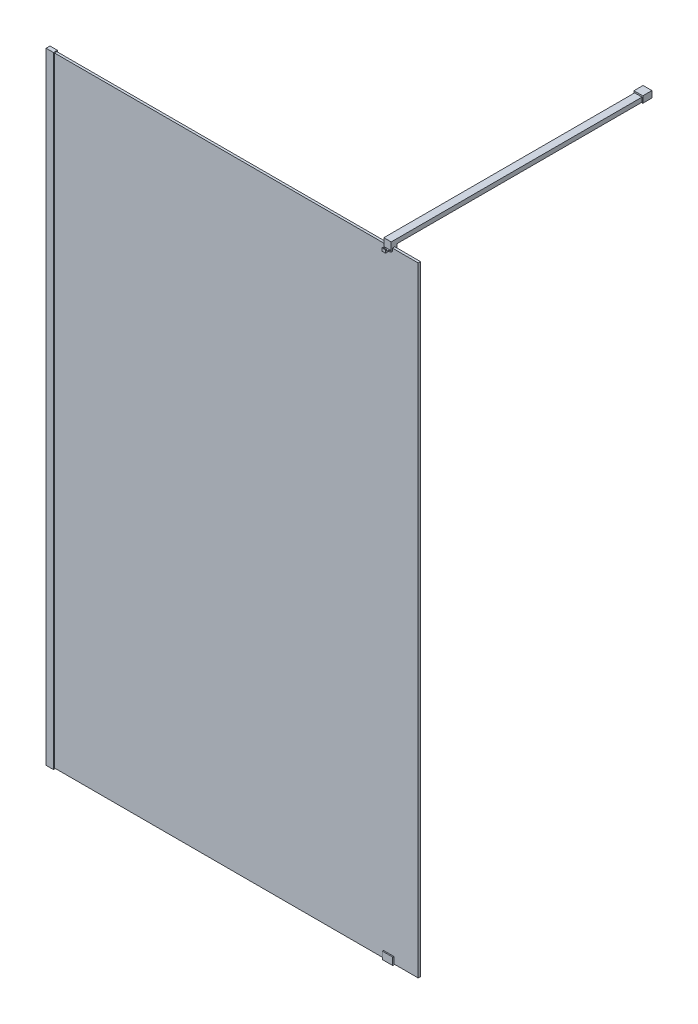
ISO-10303-21;
HEADER;
FILE_DESCRIPTION(('STEP AP214'),'2;1');
FILE_NAME('part.step','',(''),(''),'','','');
FILE_SCHEMA(('AUTOMOTIVE_DESIGN { 1 0 10303 214 1 1 1 1 }'));
ENDSEC;
DATA;
#1=APPLICATION_CONTEXT('core data for automotive mechanical design processes');
#2=APPLICATION_PROTOCOL_DEFINITION('international standard','automotive_design',2000,#1);
#3=PRODUCT_CONTEXT('',#1,'mechanical');
#4=PRODUCT('Part','Part','',(#3));
#5=PRODUCT_RELATED_PRODUCT_CATEGORY('part','',(#4));
#6=PRODUCT_DEFINITION_FORMATION('','',#4);
#7=PRODUCT_DEFINITION_CONTEXT('part definition',#1,'design');
#8=PRODUCT_DEFINITION('design','',#6,#7);
#9=PRODUCT_DEFINITION_SHAPE('','',#8);
#10=(LENGTH_UNIT() NAMED_UNIT(*) SI_UNIT(.MILLI.,.METRE.));
#11=(NAMED_UNIT(*) PLANE_ANGLE_UNIT() SI_UNIT($,.RADIAN.));
#12=(NAMED_UNIT(*) SI_UNIT($,.STERADIAN.) SOLID_ANGLE_UNIT());
#13=UNCERTAINTY_MEASURE_WITH_UNIT(LENGTH_MEASURE(1.E-05),#10,'distance_accuracy_value','');
#14=(GEOMETRIC_REPRESENTATION_CONTEXT(3) GLOBAL_UNCERTAINTY_ASSIGNED_CONTEXT((#13)) GLOBAL_UNIT_ASSIGNED_CONTEXT((#10,
#11,#12)) REPRESENTATION_CONTEXT('',''));
#15=CARTESIAN_POINT('',(0.,0.,0.));
#16=DIRECTION('',(0.,0.,1.));
#17=DIRECTION('',(1.,0.,0.));
#18=AXIS2_PLACEMENT_3D('',#15,#16,#17);
#19=CARTESIAN_POINT('',(1170.95,2090.,-19.4000000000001));
#20=DIRECTION('',(-1.,0.,0.));
#21=DIRECTION('',(0.,0.,1.));
#22=AXIS2_PLACEMENT_3D('',#19,#20,#21);
#23=PLANE('',#22);
#24=DIRECTION('',(0.,-1.,0.));
#25=VECTOR('',#24,1.);
#26=CARTESIAN_POINT('',(1170.95,2090.,-850.03));
#27=LINE('',#26,#25);
#28=CARTESIAN_POINT('',(1170.95,2120.,-850.03));
#29=VERTEX_POINT('',#28);
#30=CARTESIAN_POINT('',(1170.95,2105.,-850.03));
#31=VERTEX_POINT('',#30);
#32=EDGE_CURVE('E61',#29,#31,#27,.T.);
#33=ORIENTED_EDGE('',*,*,#32,.F.);
#34=DIRECTION('',(0.,0.,1.));
#35=VECTOR('',#34,1.);
#36=CARTESIAN_POINT('',(1170.95,2120.,0.599999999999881));
#37=LINE('',#36,#35);
#38=CARTESIAN_POINT('',(1170.95,2120.,0.599999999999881));
#39=VERTEX_POINT('',#38);
#40=EDGE_CURVE('E386',#29,#39,#37,.T.);
#41=ORIENTED_EDGE('',*,*,#40,.T.);
#42=DIRECTION('',(0.,-1.,0.));
#43=VECTOR('',#42,1.);
#44=CARTESIAN_POINT('',(1170.95,2094.,0.599999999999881));
#45=LINE('',#44,#43);
#46=CARTESIAN_POINT('',(1170.95,2094.,0.599999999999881));
#47=VERTEX_POINT('',#46);
#48=EDGE_CURVE('E388',#39,#47,#45,.T.);
#49=ORIENTED_EDGE('',*,*,#48,.T.);
#50=DIRECTION('',(0.,1.,0.));
#51=VECTOR('',#50,1.);
#52=CARTESIAN_POINT('',(1170.95,2090.,0.599999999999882));
#53=LINE('',#52,#51);
#54=CARTESIAN_POINT('',(1170.95,2090.,0.599999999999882));
#55=VERTEX_POINT('',#54);
#56=EDGE_CURVE('E332',#55,#47,#53,.T.);
#57=ORIENTED_EDGE('',*,*,#56,.F.);
#58=DIRECTION('',(0.,0.,-1.));
#59=VECTOR('',#58,1.);
#60=CARTESIAN_POINT('',(1170.95,2090.,-3.40000000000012));
#61=LINE('',#60,#59);
#62=CARTESIAN_POINT('',(1170.95,2090.,-3.40000000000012));
#63=VERTEX_POINT('',#62);
#64=EDGE_CURVE('E362',#55,#63,#61,.T.);
#65=ORIENTED_EDGE('',*,*,#64,.T.);
#66=DIRECTION('',(0.,1.,-1.30407837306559E-13));
#67=VECTOR('',#66,1.);
#68=CARTESIAN_POINT('',(1170.95,2100.,-3.40000000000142));
#69=LINE('',#68,#67);
#70=CARTESIAN_POINT('',(1170.95,2100.,-3.40000000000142));
#71=VERTEX_POINT('',#70);
#72=EDGE_CURVE('E392',#63,#71,#69,.T.);
#73=ORIENTED_EDGE('',*,*,#72,.T.);
#74=DIRECTION('',(0.,0.,-1.));
#75=VECTOR('',#74,1.);
#76=CARTESIAN_POINT('',(1170.95,2100.,-11.4000000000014));
#77=LINE('',#76,#75);
#78=CARTESIAN_POINT('',(1170.95,2100.,-11.4000000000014));
#79=VERTEX_POINT('',#78);
#80=EDGE_CURVE('E394',#71,#79,#77,.T.);
#81=ORIENTED_EDGE('',*,*,#80,.T.);
#82=DIRECTION('',(0.,-1.,1.30451205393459E-13));
#83=VECTOR('',#82,1.);
#84=CARTESIAN_POINT('',(1170.95,2090.,-11.4000000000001));
#85=LINE('',#84,#83);
#86=CARTESIAN_POINT('',(1170.95,2090.,-11.4000000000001));
#87=VERTEX_POINT('',#86);
#88=EDGE_CURVE('E395',#79,#87,#85,.T.);
#89=ORIENTED_EDGE('',*,*,#88,.T.);
#90=DIRECTION('',(0.,0.,-1.));
#91=VECTOR('',#90,1.);
#92=CARTESIAN_POINT('',(1170.95,2090.,-19.4000000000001));
#93=LINE('',#92,#91);
#94=CARTESIAN_POINT('',(1170.95,2090.,-19.4000000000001));
#95=VERTEX_POINT('',#94);
#96=EDGE_CURVE('E283',#87,#95,#93,.T.);
#97=ORIENTED_EDGE('',*,*,#96,.T.);
#98=DIRECTION('',(0.,1.,0.));
#99=VECTOR('',#98,1.);
#100=CARTESIAN_POINT('',(1170.95,2120.,-19.4000000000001));
#101=LINE('',#100,#99);
#102=CARTESIAN_POINT('',(1170.95,2105.,-19.4000000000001));
#103=VERTEX_POINT('',#102);
#104=EDGE_CURVE('E249',#95,#103,#101,.T.);
#105=ORIENTED_EDGE('',*,*,#104,.T.);
#106=DIRECTION('',(0.,0.,-1.));
#107=VECTOR('',#106,1.);
#108=CARTESIAN_POINT('',(1170.95,2105.,-881.03));
#109=LINE('',#108,#107);
#110=EDGE_CURVE('E248',#103,#31,#109,.T.);
#111=ORIENTED_EDGE('',*,*,#110,.T.);
#112=EDGE_LOOP('',(#33,#41,#49,#57,#65,#73,#81,#89,#97,#105,#111));
#113=FACE_BOUND('',#112,.T.);
#114=ADVANCED_FACE('F46',(#113),#23,.F.);
#115=CARTESIAN_POINT('',(1145.95,2090.,-19.4000000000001));
#116=DIRECTION('',(-1.,0.,0.));
#117=DIRECTION('',(0.,0.,1.));
#118=AXIS2_PLACEMENT_3D('',#115,#116,#117);
#119=PLANE('',#118);
#120=DIRECTION('',(0.,0.,1.));
#121=VECTOR('',#120,1.);
#122=CARTESIAN_POINT('',(1145.95,2120.,0.599999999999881));
#123=LINE('',#122,#121);
#124=CARTESIAN_POINT('',(1145.95,2120.,-850.03));
#125=VERTEX_POINT('',#124);
#126=CARTESIAN_POINT('',(1145.95,2120.,0.599999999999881));
#127=VERTEX_POINT('',#126);
#128=EDGE_CURVE('E272',#125,#127,#123,.T.);
#129=ORIENTED_EDGE('',*,*,#128,.F.);
#130=DIRECTION('',(0.,-1.,0.));
#131=VECTOR('',#130,1.);
#132=CARTESIAN_POINT('',(1145.95,2090.,-850.03));
#133=LINE('',#132,#131);
#134=CARTESIAN_POINT('',(1145.95,2105.,-850.03));
#135=VERTEX_POINT('',#134);
#136=EDGE_CURVE('E230',#125,#135,#133,.T.);
#137=ORIENTED_EDGE('',*,*,#136,.T.);
#138=DIRECTION('',(0.,0.,1.));
#139=VECTOR('',#138,1.);
#140=CARTESIAN_POINT('',(1145.95,2105.,-881.03));
#141=LINE('',#140,#139);
#142=CARTESIAN_POINT('',(1145.95,2105.,-19.4000000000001));
#143=VERTEX_POINT('',#142);
#144=EDGE_CURVE('E238',#135,#143,#141,.T.);
#145=ORIENTED_EDGE('',*,*,#144,.T.);
#146=DIRECTION('',(0.,1.,0.));
#147=VECTOR('',#146,1.);
#148=CARTESIAN_POINT('',(1145.95,2120.,-19.4000000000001));
#149=LINE('',#148,#147);
#150=CARTESIAN_POINT('',(1145.95,2090.,-19.4000000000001));
#151=VERTEX_POINT('',#150);
#152=EDGE_CURVE('E262',#151,#143,#149,.T.);
#153=ORIENTED_EDGE('',*,*,#152,.F.);
#154=DIRECTION('',(0.,0.,-1.));
#155=VECTOR('',#154,1.);
#156=CARTESIAN_POINT('',(1145.95,2090.,-19.4000000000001));
#157=LINE('',#156,#155);
#158=CARTESIAN_POINT('',(1145.95,2090.,-11.4000000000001));
#159=VERTEX_POINT('',#158);
#160=EDGE_CURVE('E296',#159,#151,#157,.T.);
#161=ORIENTED_EDGE('',*,*,#160,.F.);
#162=DIRECTION('',(0.,-1.,1.30451205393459E-13));
#163=VECTOR('',#162,1.);
#164=CARTESIAN_POINT('',(1145.95,2090.,-11.4000000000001));
#165=LINE('',#164,#163);
#166=CARTESIAN_POINT('',(1145.95,2100.,-11.4000000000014));
#167=VERTEX_POINT('',#166);
#168=EDGE_CURVE('E294',#167,#159,#165,.T.);
#169=ORIENTED_EDGE('',*,*,#168,.F.);
#170=DIRECTION('',(0.,0.,-1.));
#171=VECTOR('',#170,1.);
#172=CARTESIAN_POINT('',(1145.95,2100.,-11.4000000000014));
#173=LINE('',#172,#171);
#174=CARTESIAN_POINT('',(1145.95,2100.,-3.40000000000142));
#175=VERTEX_POINT('',#174);
#176=EDGE_CURVE('E292',#175,#167,#173,.T.);
#177=ORIENTED_EDGE('',*,*,#176,.F.);
#178=DIRECTION('',(0.,1.,-1.30407837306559E-13));
#179=VECTOR('',#178,1.);
#180=CARTESIAN_POINT('',(1145.95,2100.,-3.40000000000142));
#181=LINE('',#180,#179);
#182=CARTESIAN_POINT('',(1145.95,2090.,-3.40000000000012));
#183=VERTEX_POINT('',#182);
#184=EDGE_CURVE('E290',#183,#175,#181,.T.);
#185=ORIENTED_EDGE('',*,*,#184,.F.);
#186=DIRECTION('',(0.,0.,-1.));
#187=VECTOR('',#186,1.);
#188=CARTESIAN_POINT('',(1145.95,2090.,-3.40000000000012));
#189=LINE('',#188,#187);
#190=CARTESIAN_POINT('',(1145.95,2090.,0.599999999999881));
#191=VERTEX_POINT('',#190);
#192=EDGE_CURVE('E288',#191,#183,#189,.T.);
#193=ORIENTED_EDGE('',*,*,#192,.F.);
#194=DIRECTION('',(0.,1.,0.));
#195=VECTOR('',#194,1.);
#196=CARTESIAN_POINT('',(1145.95,2090.,0.599999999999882));
#197=LINE('',#196,#195);
#198=CARTESIAN_POINT('',(1145.95,2094.,0.599999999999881));
#199=VERTEX_POINT('',#198);
#200=EDGE_CURVE('E329',#191,#199,#197,.T.);
#201=ORIENTED_EDGE('',*,*,#200,.T.);
#202=DIRECTION('',(0.,-1.,0.));
#203=VECTOR('',#202,1.);
#204=CARTESIAN_POINT('',(1145.95,2094.,0.599999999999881));
#205=LINE('',#204,#203);
#206=EDGE_CURVE('E274',#127,#199,#205,.T.);
#207=ORIENTED_EDGE('',*,*,#206,.F.);
#208=EDGE_LOOP('',(#129,#137,#145,#153,#161,#169,#177,#185,#193,#201,#207));
#209=FACE_BOUND('',#208,.T.);
#210=ADVANCED_FACE('F259',(#209),#119,.T.);
#211=CARTESIAN_POINT('',(1170.95,2120.,0.599999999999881));
#212=DIRECTION('',(0.,-1.,0.));
#213=DIRECTION('',(0.,0.,-1.));
#214=AXIS2_PLACEMENT_3D('',#211,#212,#213);
#215=PLANE('',#214);
#216=DIRECTION('',(1.,0.,0.));
#217=VECTOR('',#216,1.);
#218=CARTESIAN_POINT('',(1170.95,2120.,-850.03));
#219=LINE('',#218,#217);
#220=EDGE_CURVE('E68',#125,#29,#219,.T.);
#221=ORIENTED_EDGE('',*,*,#220,.F.);
#222=ORIENTED_EDGE('',*,*,#128,.T.);
#223=DIRECTION('',(-1.,0.,0.));
#224=VECTOR('',#223,1.);
#225=CARTESIAN_POINT('',(1170.95,2120.,0.599999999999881));
#226=LINE('',#225,#224);
#227=EDGE_CURVE('E326',#39,#127,#226,.T.);
#228=ORIENTED_EDGE('',*,*,#227,.F.);
#229=ORIENTED_EDGE('',*,*,#40,.F.);
#230=EDGE_LOOP('',(#221,#222,#228,#229));
#231=FACE_BOUND('',#230,.T.);
#232=ADVANCED_FACE('F437',(#231),#215,.F.);
#233=CARTESIAN_POINT('',(1145.95,2105.,-19.4000000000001));
#234=DIRECTION('',(0.,1.,0.));
#235=DIRECTION('',(0.,0.,1.));
#236=AXIS2_PLACEMENT_3D('',#233,#234,#235);
#237=PLANE('',#236);
#238=DIRECTION('',(-1.,0.,0.));
#239=VECTOR('',#238,1.);
#240=CARTESIAN_POINT('',(1145.95,2105.,-850.03));
#241=LINE('',#240,#239);
#242=EDGE_CURVE('E12',#31,#135,#241,.T.);
#243=ORIENTED_EDGE('',*,*,#242,.F.);
#244=ORIENTED_EDGE('',*,*,#110,.F.);
#245=DIRECTION('',(1.,0.,0.));
#246=VECTOR('',#245,1.);
#247=CARTESIAN_POINT('',(1145.95,2105.,-19.4000000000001));
#248=LINE('',#247,#246);
#249=EDGE_CURVE('E244',#143,#103,#248,.T.);
#250=ORIENTED_EDGE('',*,*,#249,.F.);
#251=ORIENTED_EDGE('',*,*,#144,.F.);
#252=EDGE_LOOP('',(#243,#244,#250,#251));
#253=FACE_BOUND('',#252,.T.);
#254=ADVANCED_FACE('F265',(#253),#237,.F.);
#255=CARTESIAN_POINT('',(1170.95,2094.,9.84506801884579));
#256=DIRECTION('',(0.,-1.,0.));
#257=DIRECTION('',(0.,0.,-1.));
#258=AXIS2_PLACEMENT_3D('',#255,#256,#257);
#259=PLANE('',#258);
#260=DIRECTION('',(-0.906307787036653,0.,-0.422618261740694));
#261=VECTOR('',#260,1.);
#262=CARTESIAN_POINT('',(1170.02591161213,2094.,11.8267819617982));
#263=LINE('',#262,#261);
#264=CARTESIAN_POINT('',(1152.45,2094.,3.6309997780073));
#265=VERTEX_POINT('',#264);
#266=EDGE_CURVE('E365',#265,#199,#263,.T.);
#267=ORIENTED_EDGE('',*,*,#266,.F.);
#268=DIRECTION('',(0.,0.,-1.));
#269=VECTOR('',#268,1.);
#270=CARTESIAN_POINT('',(1152.45,2094.,9.84506801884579));
#271=LINE('',#270,#269);
#272=CARTESIAN_POINT('',(1152.45,2094.,9.84506801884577));
#273=VERTEX_POINT('',#272);
#274=EDGE_CURVE('E273',#273,#265,#271,.T.);
#275=ORIENTED_EDGE('',*,*,#274,.F.);
#276=DIRECTION('',(-1.,0.,0.));
#277=VECTOR('',#276,1.);
#278=CARTESIAN_POINT('',(1170.95,2094.,9.84506801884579));
#279=LINE('',#278,#277);
#280=CARTESIAN_POINT('',(1164.45,2094.,9.84506801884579));
#281=VERTEX_POINT('',#280);
#282=EDGE_CURVE('E320',#281,#273,#279,.T.);
#283=ORIENTED_EDGE('',*,*,#282,.F.);
#284=DIRECTION('',(0.,0.,1.));
#285=VECTOR('',#284,1.);
#286=CARTESIAN_POINT('',(1164.45,2094.,9.84506801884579));
#287=LINE('',#286,#285);
#288=CARTESIAN_POINT('',(1164.45,2094.,3.63099977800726));
#289=VERTEX_POINT('',#288);
#290=EDGE_CURVE('E379',#289,#281,#287,.T.);
#291=ORIENTED_EDGE('',*,*,#290,.F.);
#292=DIRECTION('',(-0.906307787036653,0.,0.422618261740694));
#293=VECTOR('',#292,1.);
#294=CARTESIAN_POINT('',(1167.40893350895,2094.,2.25122642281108));
#295=LINE('',#294,#293);
#296=EDGE_CURVE('E364',#47,#289,#295,.T.);
#297=ORIENTED_EDGE('',*,*,#296,.F.);
#298=DIRECTION('',(-1.,0.,0.));
#299=VECTOR('',#298,1.);
#300=CARTESIAN_POINT('',(1170.95,2094.,0.599999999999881));
#301=LINE('',#300,#299);
#302=EDGE_CURVE('E323',#47,#199,#301,.T.);
#303=ORIENTED_EDGE('',*,*,#302,.T.);
#304=EDGE_LOOP('',(#267,#275,#283,#291,#297,#303));
#305=FACE_BOUND('',#304,.T.);
#306=ADVANCED_FACE('F424',(#305),#259,.F.);
#307=CARTESIAN_POINT('',(1170.95,2100.,10.3700000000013));
#308=DIRECTION('',(0.,-0.087155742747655,0.996194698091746));
#309=DIRECTION('',(0.,-0.996194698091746,-0.087155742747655));
#310=AXIS2_PLACEMENT_3D('',#307,#308,#309);
#311=PLANE('',#310);
#312=DIRECTION('',(0.,-0.996194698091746,-0.087155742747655));
#313=VECTOR('',#312,1.);
#314=CARTESIAN_POINT('',(1152.45,2100.,10.3700000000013));
#315=LINE('',#314,#313);
#316=CARTESIAN_POINT('',(1152.45,2100.,10.3700000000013));
#317=VERTEX_POINT('',#316);
#318=EDGE_CURVE('E276',#317,#273,#315,.T.);
#319=ORIENTED_EDGE('',*,*,#318,.F.);
#320=DIRECTION('',(-1.,0.,0.));
#321=VECTOR('',#320,1.);
#322=CARTESIAN_POINT('',(1170.95,2100.,10.3700000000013));
#323=LINE('',#322,#321);
#324=CARTESIAN_POINT('',(1164.45,2100.,10.3700000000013));
#325=VERTEX_POINT('',#324);
#326=EDGE_CURVE('E317',#325,#317,#323,.T.);
#327=ORIENTED_EDGE('',*,*,#326,.F.);
#328=DIRECTION('',(0.,0.996194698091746,0.087155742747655));
#329=VECTOR('',#328,1.);
#330=CARTESIAN_POINT('',(1164.45,2100.,10.3700000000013));
#331=LINE('',#330,#329);
#332=EDGE_CURVE('E376',#281,#325,#331,.T.);
#333=ORIENTED_EDGE('',*,*,#332,.F.);
#334=ORIENTED_EDGE('',*,*,#282,.T.);
#335=EDGE_LOOP('',(#319,#327,#333,#334));
#336=FACE_BOUND('',#335,.T.);
#337=ADVANCED_FACE('F428',(#336),#311,.F.);
#338=CARTESIAN_POINT('',(1170.95,2100.,13.3700000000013));
#339=DIRECTION('',(0.,-1.,1.48029736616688E-13));
#340=DIRECTION('',(0.,-1.48029736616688E-13,-1.));
#341=AXIS2_PLACEMENT_3D('',#338,#339,#340);
#342=PLANE('',#341);
#343=DIRECTION('',(0.,-1.48029736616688E-13,-1.));
#344=VECTOR('',#343,1.);
#345=CARTESIAN_POINT('',(1152.45,2100.,13.3700000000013));
#346=LINE('',#345,#344);
#347=CARTESIAN_POINT('',(1152.45,2100.,13.3700000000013));
#348=VERTEX_POINT('',#347);
#349=EDGE_CURVE('E382',#348,#317,#346,.T.);
#350=ORIENTED_EDGE('',*,*,#349,.F.);
#351=DIRECTION('',(-1.,0.,0.));
#352=VECTOR('',#351,1.);
#353=CARTESIAN_POINT('',(1170.95,2100.,13.3700000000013));
#354=LINE('',#353,#352);
#355=CARTESIAN_POINT('',(1164.45,2100.,13.3700000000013));
#356=VERTEX_POINT('',#355);
#357=EDGE_CURVE('E314',#356,#348,#354,.T.);
#358=ORIENTED_EDGE('',*,*,#357,.F.);
#359=DIRECTION('',(0.,1.48029736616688E-13,1.));
#360=VECTOR('',#359,1.);
#361=CARTESIAN_POINT('',(1164.45,2100.,13.3700000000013));
#362=LINE('',#361,#360);
#363=EDGE_CURVE('E368',#325,#356,#362,.T.);
#364=ORIENTED_EDGE('',*,*,#363,.F.);
#365=ORIENTED_EDGE('',*,*,#326,.T.);
#366=EDGE_LOOP('',(#350,#358,#364,#365));
#367=FACE_BOUND('',#366,.T.);
#368=ADVANCED_FACE('F431',(#367),#342,.F.);
#369=CARTESIAN_POINT('',(1170.95,2090.,13.3700000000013));
#370=DIRECTION('',(0.,0.,-1.));
#371=DIRECTION('',(0.,1.,0.));
#372=AXIS2_PLACEMENT_3D('',#369,#370,#371);
#373=PLANE('',#372);
#374=ORIENTED_EDGE('',*,*,#357,.T.);
#375=DIRECTION('',(0.,-1.,0.));
#376=VECTOR('',#375,1.);
#377=CARTESIAN_POINT('',(1152.45,7813.97164808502,13.3700000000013));
#378=LINE('',#377,#376);
#379=CARTESIAN_POINT('',(1152.45,2090.,13.3700000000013));
#380=VERTEX_POINT('',#379);
#381=EDGE_CURVE('E345',#348,#380,#378,.T.);
#382=ORIENTED_EDGE('',*,*,#381,.T.);
#383=DIRECTION('',(-1.,0.,0.));
#384=VECTOR('',#383,1.);
#385=CARTESIAN_POINT('',(1170.95,2090.,13.3700000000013));
#386=LINE('',#385,#384);
#387=CARTESIAN_POINT('',(1164.45,2090.,13.3700000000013));
#388=VERTEX_POINT('',#387);
#389=EDGE_CURVE('E311',#388,#380,#386,.T.);
#390=ORIENTED_EDGE('',*,*,#389,.F.);
#391=DIRECTION('',(0.,-1.,0.));
#392=VECTOR('',#391,1.);
#393=CARTESIAN_POINT('',(1164.45,7813.97164808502,13.3700000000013));
#394=LINE('',#393,#392);
#395=EDGE_CURVE('E355',#356,#388,#394,.T.);
#396=ORIENTED_EDGE('',*,*,#395,.F.);
#397=EDGE_LOOP('',(#374,#382,#390,#396));
#398=FACE_BOUND('',#397,.T.);
#399=ADVANCED_FACE('F353',(#398),#373,.F.);
#400=CARTESIAN_POINT('',(1170.95,2090.,-3.40000000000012));
#401=DIRECTION('',(0.,1.,0.));
#402=DIRECTION('',(0.,0.,1.));
#403=AXIS2_PLACEMENT_3D('',#400,#401,#402);
#404=PLANE('',#403);
#405=DIRECTION('',(0.906307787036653,0.,0.422618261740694));
#406=VECTOR('',#405,1.);
#407=CARTESIAN_POINT('',(1164.95275623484,2090.,9.46113075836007));
#408=LINE('',#407,#406);
#409=CARTESIAN_POINT('',(1152.45,2090.,3.6309997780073));
#410=VERTEX_POINT('',#409);
#411=EDGE_CURVE('E370',#191,#410,#408,.T.);
#412=ORIENTED_EDGE('',*,*,#411,.F.);
#413=ORIENTED_EDGE('',*,*,#192,.T.);
#414=DIRECTION('',(-1.,0.,0.));
#415=VECTOR('',#414,1.);
#416=CARTESIAN_POINT('',(1170.95,2090.,-3.40000000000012));
#417=LINE('',#416,#415);
#418=EDGE_CURVE('E308',#63,#183,#417,.T.);
#419=ORIENTED_EDGE('',*,*,#418,.F.);
#420=ORIENTED_EDGE('',*,*,#64,.F.);
#421=DIRECTION('',(0.906307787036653,0.,-0.422618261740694));
#422=VECTOR('',#421,1.);
#423=CARTESIAN_POINT('',(1172.48208888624,2090.,-0.114424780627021));
#424=LINE('',#423,#422);
#425=CARTESIAN_POINT('',(1164.45,2090.,3.6309997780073));
#426=VERTEX_POINT('',#425);
#427=EDGE_CURVE('E360',#426,#55,#424,.T.);
#428=ORIENTED_EDGE('',*,*,#427,.F.);
#429=DIRECTION('',(0.,0.,-1.));
#430=VECTOR('',#429,1.);
#431=CARTESIAN_POINT('',(1164.45,2090.,-3.40000000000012));
#432=LINE('',#431,#430);
#433=EDGE_CURVE('E334',#388,#426,#432,.T.);
#434=ORIENTED_EDGE('',*,*,#433,.F.);
#435=ORIENTED_EDGE('',*,*,#389,.T.);
#436=DIRECTION('',(0.,0.,1.));
#437=VECTOR('',#436,1.);
#438=CARTESIAN_POINT('',(1152.45,2090.,-3.40000000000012));
#439=LINE('',#438,#437);
#440=EDGE_CURVE('E54',#410,#380,#439,.T.);
#441=ORIENTED_EDGE('',*,*,#440,.F.);
#442=EDGE_LOOP('',(#412,#413,#419,#420,#428,#434,#435,#441));
#443=FACE_BOUND('',#442,.T.);
#444=ADVANCED_FACE('F357',(#443),#404,.F.);
#445=CARTESIAN_POINT('',(1170.95,2120.,-19.4000000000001));
#446=DIRECTION('',(0.,0.,1.));
#447=DIRECTION('',(0.,-1.,0.));
#448=AXIS2_PLACEMENT_3D('',#445,#446,#447);
#449=PLANE('',#448);
#450=ORIENTED_EDGE('',*,*,#152,.T.);
#451=ORIENTED_EDGE('',*,*,#249,.T.);
#452=ORIENTED_EDGE('',*,*,#104,.F.);
#453=DIRECTION('',(-1.,0.,0.));
#454=VECTOR('',#453,1.);
#455=CARTESIAN_POINT('',(1170.95,2090.,-19.4000000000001));
#456=LINE('',#455,#454);
#457=EDGE_CURVE('E271',#95,#151,#456,.T.);
#458=ORIENTED_EDGE('',*,*,#457,.T.);
#459=EDGE_LOOP('',(#450,#451,#452,#458));
#460=FACE_BOUND('',#459,.T.);
#461=ADVANCED_FACE('F48',(#460),#449,.F.);
#462=CARTESIAN_POINT('',(1170.95,2094.,0.599999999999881));
#463=DIRECTION('',(0.,0.,-1.));
#464=DIRECTION('',(0.,1.,0.));
#465=AXIS2_PLACEMENT_3D('',#462,#463,#464);
#466=PLANE('',#465);
#467=ORIENTED_EDGE('',*,*,#206,.T.);
#468=ORIENTED_EDGE('',*,*,#302,.F.);
#469=ORIENTED_EDGE('',*,*,#48,.F.);
#470=ORIENTED_EDGE('',*,*,#227,.T.);
#471=EDGE_LOOP('',(#467,#468,#469,#470));
#472=FACE_BOUND('',#471,.T.);
#473=ADVANCED_FACE('F435',(#472),#466,.F.);
#474=CARTESIAN_POINT('',(1170.95,2100.,-3.40000000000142));
#475=DIRECTION('',(0.,1.30407837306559E-13,1.));
#476=DIRECTION('',(0.,-1.,1.30407837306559E-13));
#477=AXIS2_PLACEMENT_3D('',#474,#475,#476);
#478=PLANE('',#477);
#479=ORIENTED_EDGE('',*,*,#184,.T.);
#480=DIRECTION('',(-1.,0.,0.));
#481=VECTOR('',#480,1.);
#482=CARTESIAN_POINT('',(1170.95,2100.,-3.40000000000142));
#483=LINE('',#482,#481);
#484=EDGE_CURVE('E305',#71,#175,#483,.T.);
#485=ORIENTED_EDGE('',*,*,#484,.F.);
#486=ORIENTED_EDGE('',*,*,#72,.F.);
#487=ORIENTED_EDGE('',*,*,#418,.T.);
#488=EDGE_LOOP('',(#479,#485,#486,#487));
#489=FACE_BOUND('',#488,.T.);
#490=ADVANCED_FACE('F413',(#489),#478,.F.);
#491=CARTESIAN_POINT('',(1170.95,2100.,-11.4000000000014));
#492=DIRECTION('',(0.,1.,0.));
#493=DIRECTION('',(0.,0.,1.));
#494=AXIS2_PLACEMENT_3D('',#491,#492,#493);
#495=PLANE('',#494);
#496=ORIENTED_EDGE('',*,*,#176,.T.);
#497=DIRECTION('',(-1.,0.,0.));
#498=VECTOR('',#497,1.);
#499=CARTESIAN_POINT('',(1170.95,2100.,-11.4000000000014));
#500=LINE('',#499,#498);
#501=EDGE_CURVE('E302',#79,#167,#500,.T.);
#502=ORIENTED_EDGE('',*,*,#501,.F.);
#503=ORIENTED_EDGE('',*,*,#80,.F.);
#504=ORIENTED_EDGE('',*,*,#484,.T.);
#505=EDGE_LOOP('',(#496,#502,#503,#504));
#506=FACE_BOUND('',#505,.T.);
#507=ADVANCED_FACE('F409',(#506),#495,.F.);
#508=CARTESIAN_POINT('',(1170.95,2090.,-11.4000000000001));
#509=DIRECTION('',(0.,-1.30451205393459E-13,-1.));
#510=DIRECTION('',(0.,1.,-1.30451205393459E-13));
#511=AXIS2_PLACEMENT_3D('',#508,#509,#510);
#512=PLANE('',#511);
#513=ORIENTED_EDGE('',*,*,#168,.T.);
#514=DIRECTION('',(-1.,0.,0.));
#515=VECTOR('',#514,1.);
#516=CARTESIAN_POINT('',(1170.95,2090.,-11.4000000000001));
#517=LINE('',#516,#515);
#518=EDGE_CURVE('E299',#87,#159,#517,.T.);
#519=ORIENTED_EDGE('',*,*,#518,.F.);
#520=ORIENTED_EDGE('',*,*,#88,.F.);
#521=ORIENTED_EDGE('',*,*,#501,.T.);
#522=EDGE_LOOP('',(#513,#519,#520,#521));
#523=FACE_BOUND('',#522,.T.);
#524=ADVANCED_FACE('F405',(#523),#512,.F.);
#525=CARTESIAN_POINT('',(1170.95,2090.,-19.4000000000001));
#526=DIRECTION('',(0.,1.,0.));
#527=DIRECTION('',(0.,0.,1.));
#528=AXIS2_PLACEMENT_3D('',#525,#526,#527);
#529=PLANE('',#528);
#530=ORIENTED_EDGE('',*,*,#160,.T.);
#531=ORIENTED_EDGE('',*,*,#457,.F.);
#532=ORIENTED_EDGE('',*,*,#96,.F.);
#533=ORIENTED_EDGE('',*,*,#518,.T.);
#534=EDGE_LOOP('',(#530,#531,#532,#533));
#535=FACE_BOUND('',#534,.T.);
#536=ADVANCED_FACE('F400',(#535),#529,.F.);
#537=CARTESIAN_POINT('',(1145.95,7813.97164808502,0.599999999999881));
#538=DIRECTION('',(-0.422618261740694,0.,0.906307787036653));
#539=DIRECTION('',(0.906307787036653,0.,0.422618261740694));
#540=AXIS2_PLACEMENT_3D('',#537,#538,#539);
#541=PLANE('',#540);
#542=DIRECTION('',(0.,-1.,0.));
#543=VECTOR('',#542,1.);
#544=CARTESIAN_POINT('',(1152.45,7813.97164808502,3.6309997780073));
#545=LINE('',#544,#543);
#546=EDGE_CURVE('E348',#265,#410,#545,.T.);
#547=ORIENTED_EDGE('',*,*,#546,.F.);
#548=ORIENTED_EDGE('',*,*,#266,.T.);
#549=ORIENTED_EDGE('',*,*,#200,.F.);
#550=ORIENTED_EDGE('',*,*,#411,.T.);
#551=EDGE_LOOP('',(#547,#548,#549,#550));
#552=FACE_BOUND('',#551,.T.);
#553=ADVANCED_FACE('F432',(#552),#541,.T.);
#554=CARTESIAN_POINT('',(1152.45,7813.97164808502,3.6309997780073));
#555=DIRECTION('',(-1.,0.,0.));
#556=DIRECTION('',(0.,0.,1.));
#557=AXIS2_PLACEMENT_3D('',#554,#555,#556);
#558=PLANE('',#557);
#559=ORIENTED_EDGE('',*,*,#318,.T.);
#560=ORIENTED_EDGE('',*,*,#274,.T.);
#561=ORIENTED_EDGE('',*,*,#546,.T.);
#562=ORIENTED_EDGE('',*,*,#440,.T.);
#563=ORIENTED_EDGE('',*,*,#381,.F.);
#564=ORIENTED_EDGE('',*,*,#349,.T.);
#565=EDGE_LOOP('',(#559,#560,#561,#562,#563,#564));
#566=FACE_BOUND('',#565,.T.);
#567=ADVANCED_FACE('F344',(#566),#558,.T.);
#568=CARTESIAN_POINT('',(1164.45,7813.97164808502,3.6309997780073));
#569=DIRECTION('',(1.,0.,0.));
#570=DIRECTION('',(0.,0.,-1.));
#571=AXIS2_PLACEMENT_3D('',#568,#569,#570);
#572=PLANE('',#571);
#573=DIRECTION('',(0.,-1.,0.));
#574=VECTOR('',#573,1.);
#575=CARTESIAN_POINT('',(1164.45,7813.97164808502,3.6309997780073));
#576=LINE('',#575,#574);
#577=EDGE_CURVE('E241',#289,#426,#576,.T.);
#578=ORIENTED_EDGE('',*,*,#577,.F.);
#579=ORIENTED_EDGE('',*,*,#290,.T.);
#580=ORIENTED_EDGE('',*,*,#332,.T.);
#581=ORIENTED_EDGE('',*,*,#363,.T.);
#582=ORIENTED_EDGE('',*,*,#395,.T.);
#583=ORIENTED_EDGE('',*,*,#433,.T.);
#584=EDGE_LOOP('',(#578,#579,#580,#581,#582,#583));
#585=FACE_BOUND('',#584,.T.);
#586=ADVANCED_FACE('F420',(#585),#572,.T.);
#587=CARTESIAN_POINT('',(1170.95,7813.97164808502,0.599999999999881));
#588=DIRECTION('',(0.422618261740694,0.,0.906307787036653));
#589=DIRECTION('',(0.906307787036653,0.,-0.422618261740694));
#590=AXIS2_PLACEMENT_3D('',#587,#588,#589);
#591=PLANE('',#590);
#592=ORIENTED_EDGE('',*,*,#56,.T.);
#593=ORIENTED_EDGE('',*,*,#296,.T.);
#594=ORIENTED_EDGE('',*,*,#577,.T.);
#595=ORIENTED_EDGE('',*,*,#427,.T.);
#596=EDGE_LOOP('',(#592,#593,#594,#595));
#597=FACE_BOUND('',#596,.T.);
#598=ADVANCED_FACE('F418',(#597),#591,.T.);
#599=CARTESIAN_POINT('',(1143.44999999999,2103.,-850.03));
#600=DIRECTION('',(0.,0.,-1.));
#601=DIRECTION('',(-1.,0.,0.));
#602=AXIS2_PLACEMENT_3D('',#599,#600,#601);
#603=PLANE('',#602);
#604=DIRECTION('',(0.,1.,0.));
#605=VECTOR('',#604,1.);
#606=CARTESIAN_POINT('',(1143.44999999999,2125.,-850.03));
#607=LINE('',#606,#605);
#608=CARTESIAN_POINT('',(1143.44999999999,2103.,-850.03));
#609=VERTEX_POINT('',#608);
#610=CARTESIAN_POINT('',(1143.44999999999,2125.,-850.03));
#611=VERTEX_POINT('',#610);
#612=EDGE_CURVE('E209',#609,#611,#607,.T.);
#613=ORIENTED_EDGE('',*,*,#612,.F.);
#614=DIRECTION('',(-1.,0.,0.));
#615=VECTOR('',#614,1.);
#616=CARTESIAN_POINT('',(1173.44999999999,2103.,-850.03));
#617=LINE('',#616,#615);
#618=CARTESIAN_POINT('',(1173.44999999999,2103.,-850.03));
#619=VERTEX_POINT('',#618);
#620=EDGE_CURVE('E201',#619,#609,#617,.T.);
#621=ORIENTED_EDGE('',*,*,#620,.F.);
#622=DIRECTION('',(0.,-1.,0.));
#623=VECTOR('',#622,1.);
#624=CARTESIAN_POINT('',(1173.44999999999,2125.,-850.03));
#625=LINE('',#624,#623);
#626=CARTESIAN_POINT('',(1173.44999999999,2125.,-850.03));
#627=VERTEX_POINT('',#626);
#628=EDGE_CURVE('E212',#627,#619,#625,.T.);
#629=ORIENTED_EDGE('',*,*,#628,.F.);
#630=DIRECTION('',(1.,0.,0.));
#631=VECTOR('',#630,1.);
#632=CARTESIAN_POINT('',(1173.44999999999,2125.,-850.03));
#633=LINE('',#632,#631);
#634=EDGE_CURVE('E193',#611,#627,#633,.T.);
#635=ORIENTED_EDGE('',*,*,#634,.F.);
#636=EDGE_LOOP('',(#613,#621,#629,#635));
#637=FACE_BOUND('',#636,.T.);
#638=ORIENTED_EDGE('',*,*,#136,.F.);
#639=ORIENTED_EDGE('',*,*,#220,.T.);
#640=ORIENTED_EDGE('',*,*,#32,.T.);
#641=ORIENTED_EDGE('',*,*,#242,.T.);
#642=EDGE_LOOP('',(#638,#639,#640,#641));
#643=FACE_BOUND('',#642,.T.);
#644=ADVANCED_FACE('F206',(#637,#643),#603,.F.);
#645=CARTESIAN_POINT('',(1143.44999999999,2125.,-850.03));
#646=DIRECTION('',(-1.,0.,0.));
#647=DIRECTION('',(0.,0.,1.));
#648=AXIS2_PLACEMENT_3D('',#645,#646,#647);
#649=PLANE('',#648);
#650=DIRECTION('',(0.,1.,0.));
#651=VECTOR('',#650,1.);
#652=CARTESIAN_POINT('',(1143.44999999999,2125.,-881.03));
#653=LINE('',#652,#651);
#654=CARTESIAN_POINT('',(1143.44999999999,2103.,-881.03));
#655=VERTEX_POINT('',#654);
#656=CARTESIAN_POINT('',(1143.44999999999,2125.,-881.03));
#657=VERTEX_POINT('',#656);
#658=EDGE_CURVE('E224',#655,#657,#653,.T.);
#659=ORIENTED_EDGE('',*,*,#658,.F.);
#660=DIRECTION('',(0.,0.,-1.));
#661=VECTOR('',#660,1.);
#662=CARTESIAN_POINT('',(1143.44999999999,2103.,-850.03));
#663=LINE('',#662,#661);
#664=EDGE_CURVE('E215',#609,#655,#663,.T.);
#665=ORIENTED_EDGE('',*,*,#664,.F.);
#666=ORIENTED_EDGE('',*,*,#612,.T.);
#667=DIRECTION('',(0.,0.,-1.));
#668=VECTOR('',#667,1.);
#669=CARTESIAN_POINT('',(1143.44999999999,2125.,-850.03));
#670=LINE('',#669,#668);
#671=EDGE_CURVE('E190',#611,#657,#670,.T.);
#672=ORIENTED_EDGE('',*,*,#671,.T.);
#673=EDGE_LOOP('',(#659,#665,#666,#672));
#674=FACE_BOUND('',#673,.T.);
#675=ADVANCED_FACE('F214',(#674),#649,.T.);
#676=CARTESIAN_POINT('',(1173.44999999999,2103.,-850.03));
#677=DIRECTION('',(0.,-1.,0.));
#678=DIRECTION('',(0.,0.,-1.));
#679=AXIS2_PLACEMENT_3D('',#676,#677,#678);
#680=PLANE('',#679);
#681=DIRECTION('',(-1.,0.,0.));
#682=VECTOR('',#681,1.);
#683=CARTESIAN_POINT('',(1173.44999999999,2103.,-881.03));
#684=LINE('',#683,#682);
#685=CARTESIAN_POINT('',(1173.44999999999,2103.,-881.03));
#686=VERTEX_POINT('',#685);
#687=EDGE_CURVE('E216',#686,#655,#684,.T.);
#688=ORIENTED_EDGE('',*,*,#687,.F.);
#689=DIRECTION('',(0.,0.,-1.));
#690=VECTOR('',#689,1.);
#691=CARTESIAN_POINT('',(1173.44999999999,2103.,-850.03));
#692=LINE('',#691,#690);
#693=EDGE_CURVE('E231',#619,#686,#692,.T.);
#694=ORIENTED_EDGE('',*,*,#693,.F.);
#695=ORIENTED_EDGE('',*,*,#620,.T.);
#696=ORIENTED_EDGE('',*,*,#664,.T.);
#697=EDGE_LOOP('',(#688,#694,#695,#696));
#698=FACE_BOUND('',#697,.T.);
#699=ADVANCED_FACE('F444',(#698),#680,.T.);
#700=CARTESIAN_POINT('',(1173.44999999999,2125.,-850.03));
#701=DIRECTION('',(1.,0.,0.));
#702=DIRECTION('',(0.,0.,-1.));
#703=AXIS2_PLACEMENT_3D('',#700,#701,#702);
#704=PLANE('',#703);
#705=DIRECTION('',(0.,-1.,0.));
#706=VECTOR('',#705,1.);
#707=CARTESIAN_POINT('',(1173.44999999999,2125.,-881.03));
#708=LINE('',#707,#706);
#709=CARTESIAN_POINT('',(1173.44999999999,2125.,-881.03));
#710=VERTEX_POINT('',#709);
#711=EDGE_CURVE('E219',#710,#686,#708,.T.);
#712=ORIENTED_EDGE('',*,*,#711,.F.);
#713=DIRECTION('',(0.,0.,-1.));
#714=VECTOR('',#713,1.);
#715=CARTESIAN_POINT('',(1173.44999999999,2125.,-850.03));
#716=LINE('',#715,#714);
#717=EDGE_CURVE('E200',#627,#710,#716,.T.);
#718=ORIENTED_EDGE('',*,*,#717,.F.);
#719=ORIENTED_EDGE('',*,*,#628,.T.);
#720=ORIENTED_EDGE('',*,*,#693,.T.);
#721=EDGE_LOOP('',(#712,#718,#719,#720));
#722=FACE_BOUND('',#721,.T.);
#723=ADVANCED_FACE('F612',(#722),#704,.T.);
#724=CARTESIAN_POINT('',(1173.44999999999,2125.,-850.03));
#725=DIRECTION('',(0.,1.,0.));
#726=DIRECTION('',(0.,0.,1.));
#727=AXIS2_PLACEMENT_3D('',#724,#725,#726);
#728=PLANE('',#727);
#729=DIRECTION('',(1.,0.,0.));
#730=VECTOR('',#729,1.);
#731=CARTESIAN_POINT('',(1173.44999999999,2125.,-881.03));
#732=LINE('',#731,#730);
#733=EDGE_CURVE('E195',#657,#710,#732,.T.);
#734=ORIENTED_EDGE('',*,*,#733,.F.);
#735=ORIENTED_EDGE('',*,*,#671,.F.);
#736=ORIENTED_EDGE('',*,*,#634,.T.);
#737=ORIENTED_EDGE('',*,*,#717,.T.);
#738=EDGE_LOOP('',(#734,#735,#736,#737));
#739=FACE_BOUND('',#738,.T.);
#740=ADVANCED_FACE('F192',(#739),#728,.T.);
#741=CARTESIAN_POINT('',(1145.95,2105.,-881.03));
#742=DIRECTION('',(0.,0.,-1.));
#743=DIRECTION('',(-1.,0.,0.));
#744=AXIS2_PLACEMENT_3D('',#741,#742,#743);
#745=PLANE('',#744);
#746=ORIENTED_EDGE('',*,*,#658,.T.);
#747=ORIENTED_EDGE('',*,*,#733,.T.);
#748=ORIENTED_EDGE('',*,*,#711,.T.);
#749=ORIENTED_EDGE('',*,*,#687,.T.);
#750=EDGE_LOOP('',(#746,#747,#748,#749));
#751=FACE_BOUND('',#750,.T.);
#752=ADVANCED_FACE('F485',(#751),#745,.T.);
#753=CLOSED_SHELL('',(#114,#210,#232,#254,#306,#337,#368,#399,#444,#461,#473,#490,#507,#524,
#536,#553,#567,#586,#598,#644,#675,#699,#723,#740,#752));
#754=MANIFOLD_SOLID_BREP('B2',#753);
#755=CARTESIAN_POINT('',(1175.95,22.,-11.4000000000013));
#756=DIRECTION('',(0.,0.,-1.));
#757=DIRECTION('',(0.,1.,0.));
#758=AXIS2_PLACEMENT_3D('',#755,#756,#757);
#759=PLANE('',#758);
#760=DIRECTION('',(0.,-1.,0.));
#761=VECTOR('',#760,1.);
#762=CARTESIAN_POINT('',(1140.95,22.,-11.4000000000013));
#763=LINE('',#762,#761);
#764=CARTESIAN_POINT('',(1140.95,22.,-11.4000000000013));
#765=VERTEX_POINT('',#764);
#766=CARTESIAN_POINT('',(1140.95,0.,-11.4));
#767=VERTEX_POINT('',#766);
#768=EDGE_CURVE('E765',#765,#767,#763,.T.);
#769=ORIENTED_EDGE('',*,*,#768,.T.);
#770=DIRECTION('',(-1.,0.,0.));
#771=VECTOR('',#770,1.);
#772=CARTESIAN_POINT('',(1175.95,0.,-11.4));
#773=LINE('',#772,#771);
#774=CARTESIAN_POINT('',(1175.95,0.,-11.4));
#775=VERTEX_POINT('',#774);
#776=EDGE_CURVE('E44',#775,#767,#773,.T.);
#777=ORIENTED_EDGE('',*,*,#776,.F.);
#778=DIRECTION('',(0.,-1.,0.));
#779=VECTOR('',#778,1.);
#780=CARTESIAN_POINT('',(1175.95,22.,-11.4000000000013));
#781=LINE('',#780,#779);
#782=CARTESIAN_POINT('',(1175.95,22.,-11.4000000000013));
#783=VERTEX_POINT('',#782);
#784=EDGE_CURVE('E779',#783,#775,#781,.T.);
#785=ORIENTED_EDGE('',*,*,#784,.F.);
#786=DIRECTION('',(-1.,0.,0.));
#787=VECTOR('',#786,1.);
#788=CARTESIAN_POINT('',(1175.95,22.,-11.4000000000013));
#789=LINE('',#788,#787);
#790=EDGE_CURVE('E761',#783,#765,#789,.T.);
#791=ORIENTED_EDGE('',*,*,#790,.T.);
#792=EDGE_LOOP('',(#769,#777,#785,#791));
#793=FACE_BOUND('',#792,.T.);
#794=ADVANCED_FACE('F669',(#793),#759,.F.);
#795=CARTESIAN_POINT('',(1175.95,0.,-11.4));
#796=DIRECTION('',(0.,-1.,0.));
#797=DIRECTION('',(0.,0.,-1.));
#798=AXIS2_PLACEMENT_3D('',#795,#796,#797);
#799=PLANE('',#798);
#800=DIRECTION('',(0.,0.,1.));
#801=VECTOR('',#800,1.);
#802=CARTESIAN_POINT('',(1140.95,0.,-11.4));
#803=LINE('',#802,#801);
#804=CARTESIAN_POINT('',(1140.95,0.,-3.4));
#805=VERTEX_POINT('',#804);
#806=EDGE_CURVE('E768',#767,#805,#803,.T.);
#807=ORIENTED_EDGE('',*,*,#806,.T.);
#808=DIRECTION('',(-1.,0.,0.));
#809=VECTOR('',#808,1.);
#810=CARTESIAN_POINT('',(1175.95,0.,-3.4));
#811=LINE('',#810,#809);
#812=CARTESIAN_POINT('',(1175.95,0.,-3.4));
#813=VERTEX_POINT('',#812);
#814=EDGE_CURVE('E677',#813,#805,#811,.T.);
#815=ORIENTED_EDGE('',*,*,#814,.F.);
#816=DIRECTION('',(0.,0.,1.));
#817=VECTOR('',#816,1.);
#818=CARTESIAN_POINT('',(1175.95,0.,-11.4));
#819=LINE('',#818,#817);
#820=EDGE_CURVE('E728',#775,#813,#819,.T.);
#821=ORIENTED_EDGE('',*,*,#820,.F.);
#822=ORIENTED_EDGE('',*,*,#776,.T.);
#823=EDGE_LOOP('',(#807,#815,#821,#822));
#824=FACE_BOUND('',#823,.T.);
#825=ADVANCED_FACE('F814',(#824),#799,.F.);
#826=CARTESIAN_POINT('',(1175.95,0.,-3.4));
#827=DIRECTION('',(0.,0.,1.));
#828=DIRECTION('',(0.,-1.,0.));
#829=AXIS2_PLACEMENT_3D('',#826,#827,#828);
#830=PLANE('',#829);
#831=DIRECTION('',(0.,1.,0.));
#832=VECTOR('',#831,1.);
#833=CARTESIAN_POINT('',(1140.95,0.,-3.4));
#834=LINE('',#833,#832);
#835=CARTESIAN_POINT('',(1140.95,21.9999999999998,-3.4000000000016));
#836=VERTEX_POINT('',#835);
#837=EDGE_CURVE('E770',#805,#836,#834,.T.);
#838=ORIENTED_EDGE('',*,*,#837,.T.);
#839=DIRECTION('',(-1.,0.,0.));
#840=VECTOR('',#839,1.);
#841=CARTESIAN_POINT('',(1175.95,21.9999999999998,-3.4000000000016));
#842=LINE('',#841,#840);
#843=CARTESIAN_POINT('',(1175.95,21.9999999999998,-3.4000000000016));
#844=VERTEX_POINT('',#843);
#845=EDGE_CURVE('E786',#844,#836,#842,.T.);
#846=ORIENTED_EDGE('',*,*,#845,.F.);
#847=DIRECTION('',(0.,1.,0.));
#848=VECTOR('',#847,1.);
#849=CARTESIAN_POINT('',(1175.95,0.,-3.4));
#850=LINE('',#849,#848);
#851=EDGE_CURVE('E794',#813,#844,#850,.T.);
#852=ORIENTED_EDGE('',*,*,#851,.F.);
#853=ORIENTED_EDGE('',*,*,#814,.T.);
#854=EDGE_LOOP('',(#838,#846,#852,#853));
#855=FACE_BOUND('',#854,.T.);
#856=ADVANCED_FACE('F792',(#855),#830,.F.);
#857=CARTESIAN_POINT('',(1175.95,22.,0.349999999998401));
#858=DIRECTION('',(0.,-1.,0.));
#859=DIRECTION('',(0.,0.,-1.));
#860=AXIS2_PLACEMENT_3D('',#857,#858,#859);
#861=PLANE('',#860);
#862=DIRECTION('',(0.,0.,1.));
#863=VECTOR('',#862,1.);
#864=CARTESIAN_POINT('',(1140.95,22.,0.349999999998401));
#865=LINE('',#864,#863);
#866=CARTESIAN_POINT('',(1140.95,22.,0.349999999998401));
#867=VERTEX_POINT('',#866);
#868=EDGE_CURVE('E772',#836,#867,#865,.T.);
#869=ORIENTED_EDGE('',*,*,#868,.T.);
#870=DIRECTION('',(-1.,0.,0.));
#871=VECTOR('',#870,1.);
#872=CARTESIAN_POINT('',(1175.95,22.,0.349999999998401));
#873=LINE('',#872,#871);
#874=CARTESIAN_POINT('',(1175.95,22.,0.349999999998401));
#875=VERTEX_POINT('',#874);
#876=EDGE_CURVE('E783',#875,#867,#873,.T.);
#877=ORIENTED_EDGE('',*,*,#876,.F.);
#878=DIRECTION('',(0.,0.,1.));
#879=VECTOR('',#878,1.);
#880=CARTESIAN_POINT('',(1175.95,22.,0.349999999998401));
#881=LINE('',#880,#879);
#882=EDGE_CURVE('E806',#844,#875,#881,.T.);
#883=ORIENTED_EDGE('',*,*,#882,.F.);
#884=ORIENTED_EDGE('',*,*,#845,.T.);
#885=EDGE_LOOP('',(#869,#877,#883,#884));
#886=FACE_BOUND('',#885,.T.);
#887=ADVANCED_FACE('F802',(#886),#861,.F.);
#888=CARTESIAN_POINT('',(1175.95,-3.,0.349999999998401));
#889=DIRECTION('',(0.,0.,-1.));
#890=DIRECTION('',(-1.,0.,0.));
#891=AXIS2_PLACEMENT_3D('',#888,#889,#890);
#892=PLANE('',#891);
#893=DIRECTION('',(0.,-1.,0.));
#894=VECTOR('',#893,1.);
#895=CARTESIAN_POINT('',(1140.95,-3.,0.349999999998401));
#896=LINE('',#895,#894);
#897=CARTESIAN_POINT('',(1140.95,-3.,0.349999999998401));
#898=VERTEX_POINT('',#897);
#899=EDGE_CURVE('E774',#867,#898,#896,.T.);
#900=ORIENTED_EDGE('',*,*,#899,.T.);
#901=DIRECTION('',(-1.,0.,0.));
#902=VECTOR('',#901,1.);
#903=CARTESIAN_POINT('',(1175.95,-3.,0.349999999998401));
#904=LINE('',#903,#902);
#905=CARTESIAN_POINT('',(1175.95,-3.,0.349999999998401));
#906=VERTEX_POINT('',#905);
#907=EDGE_CURVE('E756',#906,#898,#904,.T.);
#908=ORIENTED_EDGE('',*,*,#907,.F.);
#909=DIRECTION('',(0.,-1.,0.));
#910=VECTOR('',#909,1.);
#911=CARTESIAN_POINT('',(1175.95,-3.,0.349999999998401));
#912=LINE('',#911,#910);
#913=EDGE_CURVE('E747',#875,#906,#912,.T.);
#914=ORIENTED_EDGE('',*,*,#913,.F.);
#915=ORIENTED_EDGE('',*,*,#876,.T.);
#916=EDGE_LOOP('',(#900,#908,#914,#915));
#917=FACE_BOUND('',#916,.T.);
#918=ADVANCED_FACE('F805',(#917),#892,.F.);
#919=CARTESIAN_POINT('',(1175.95,-3.,-15.7500000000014));
#920=DIRECTION('',(0.,1.,0.));
#921=DIRECTION('',(0.,0.,1.));
#922=AXIS2_PLACEMENT_3D('',#919,#920,#921);
#923=PLANE('',#922);
#924=DIRECTION('',(0.,0.,-1.));
#925=VECTOR('',#924,1.);
#926=CARTESIAN_POINT('',(1140.95,-3.,-15.7500000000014));
#927=LINE('',#926,#925);
#928=CARTESIAN_POINT('',(1140.95,-3.,-15.7500000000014));
#929=VERTEX_POINT('',#928);
#930=EDGE_CURVE('E755',#898,#929,#927,.T.);
#931=ORIENTED_EDGE('',*,*,#930,.T.);
#932=DIRECTION('',(-1.,0.,0.));
#933=VECTOR('',#932,1.);
#934=CARTESIAN_POINT('',(1175.95,-3.,-15.7500000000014));
#935=LINE('',#934,#933);
#936=CARTESIAN_POINT('',(1175.95,-3.,-15.7500000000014));
#937=VERTEX_POINT('',#936);
#938=EDGE_CURVE('E752',#937,#929,#935,.T.);
#939=ORIENTED_EDGE('',*,*,#938,.F.);
#940=DIRECTION('',(0.,0.,-1.));
#941=VECTOR('',#940,1.);
#942=CARTESIAN_POINT('',(1175.95,-3.,-15.7500000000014));
#943=LINE('',#942,#941);
#944=EDGE_CURVE('E741',#906,#937,#943,.T.);
#945=ORIENTED_EDGE('',*,*,#944,.F.);
#946=ORIENTED_EDGE('',*,*,#907,.T.);
#947=EDGE_LOOP('',(#931,#939,#945,#946));
#948=FACE_BOUND('',#947,.T.);
#949=ADVANCED_FACE('F753',(#948),#923,.F.);
#950=CARTESIAN_POINT('',(1175.95,22.,-15.7500000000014));
#951=DIRECTION('',(0.,0.,1.));
#952=DIRECTION('',(0.,-1.,0.));
#953=AXIS2_PLACEMENT_3D('',#950,#951,#952);
#954=PLANE('',#953);
#955=DIRECTION('',(0.,1.,0.));
#956=VECTOR('',#955,1.);
#957=CARTESIAN_POINT('',(1140.95,22.,-15.7500000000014));
#958=LINE('',#957,#956);
#959=CARTESIAN_POINT('',(1140.95,22.,-15.7500000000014));
#960=VERTEX_POINT('',#959);
#961=EDGE_CURVE('E714',#929,#960,#958,.T.);
#962=ORIENTED_EDGE('',*,*,#961,.T.);
#963=DIRECTION('',(-1.,0.,0.));
#964=VECTOR('',#963,1.);
#965=CARTESIAN_POINT('',(1175.95,22.,-15.7500000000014));
#966=LINE('',#965,#964);
#967=CARTESIAN_POINT('',(1175.95,22.,-15.7500000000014));
#968=VERTEX_POINT('',#967);
#969=EDGE_CURVE('E757',#968,#960,#966,.T.);
#970=ORIENTED_EDGE('',*,*,#969,.F.);
#971=DIRECTION('',(0.,1.,0.));
#972=VECTOR('',#971,1.);
#973=CARTESIAN_POINT('',(1175.95,22.,-15.7500000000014));
#974=LINE('',#973,#972);
#975=EDGE_CURVE('E745',#937,#968,#974,.T.);
#976=ORIENTED_EDGE('',*,*,#975,.F.);
#977=ORIENTED_EDGE('',*,*,#938,.T.);
#978=EDGE_LOOP('',(#962,#970,#976,#977));
#979=FACE_BOUND('',#978,.T.);
#980=ADVANCED_FACE('F759',(#979),#954,.F.);
#981=CARTESIAN_POINT('',(1175.95,22.,-11.4000000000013));
#982=DIRECTION('',(0.,-1.,0.));
#983=DIRECTION('',(0.,0.,-1.));
#984=AXIS2_PLACEMENT_3D('',#981,#982,#983);
#985=PLANE('',#984);
#986=DIRECTION('',(0.,0.,1.));
#987=VECTOR('',#986,1.);
#988=CARTESIAN_POINT('',(1140.95,22.,-11.4000000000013));
#989=LINE('',#988,#987);
#990=EDGE_CURVE('E720',#960,#765,#989,.T.);
#991=ORIENTED_EDGE('',*,*,#990,.T.);
#992=ORIENTED_EDGE('',*,*,#790,.F.);
#993=DIRECTION('',(0.,0.,1.));
#994=VECTOR('',#993,1.);
#995=CARTESIAN_POINT('',(1175.95,22.,-11.4000000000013));
#996=LINE('',#995,#994);
#997=EDGE_CURVE('E685',#968,#783,#996,.T.);
#998=ORIENTED_EDGE('',*,*,#997,.F.);
#999=ORIENTED_EDGE('',*,*,#969,.T.);
#1000=EDGE_LOOP('',(#991,#992,#998,#999));
#1001=FACE_BOUND('',#1000,.T.);
#1002=ADVANCED_FACE('F830',(#1001),#985,.F.);
#1003=CARTESIAN_POINT('',(1175.95,0.,-11.4));
#1004=DIRECTION('',(-1.,0.,0.));
#1005=DIRECTION('',(0.,0.,1.));
#1006=AXIS2_PLACEMENT_3D('',#1003,#1004,#1005);
#1007=PLANE('',#1006);
#1008=ORIENTED_EDGE('',*,*,#784,.T.);
#1009=ORIENTED_EDGE('',*,*,#820,.T.);
#1010=ORIENTED_EDGE('',*,*,#851,.T.);
#1011=ORIENTED_EDGE('',*,*,#882,.T.);
#1012=ORIENTED_EDGE('',*,*,#913,.T.);
#1013=ORIENTED_EDGE('',*,*,#944,.T.);
#1014=ORIENTED_EDGE('',*,*,#975,.T.);
#1015=ORIENTED_EDGE('',*,*,#997,.T.);
#1016=EDGE_LOOP('',(#1008,#1009,#1010,#1011,#1012,#1013,#1014,#1015));
#1017=FACE_BOUND('',#1016,.T.);
#1018=ADVANCED_FACE('F743',(#1017),#1007,.F.);
#1019=CARTESIAN_POINT('',(1140.95,0.,-11.4));
#1020=DIRECTION('',(-1.,0.,0.));
#1021=DIRECTION('',(0.,0.,1.));
#1022=AXIS2_PLACEMENT_3D('',#1019,#1020,#1021);
#1023=PLANE('',#1022);
#1024=ORIENTED_EDGE('',*,*,#768,.F.);
#1025=ORIENTED_EDGE('',*,*,#990,.F.);
#1026=ORIENTED_EDGE('',*,*,#961,.F.);
#1027=ORIENTED_EDGE('',*,*,#930,.F.);
#1028=ORIENTED_EDGE('',*,*,#899,.F.);
#1029=ORIENTED_EDGE('',*,*,#868,.F.);
#1030=ORIENTED_EDGE('',*,*,#837,.F.);
#1031=ORIENTED_EDGE('',*,*,#806,.F.);
#1032=EDGE_LOOP('',(#1024,#1025,#1026,#1027,#1028,#1029,#1030,#1031));
#1033=FACE_BOUND('',#1032,.T.);
#1034=ADVANCED_FACE('F798',(#1033),#1023,.T.);
#1035=CLOSED_SHELL('',(#794,#825,#856,#887,#918,#949,#980,#1002,#1018,#1034));
#1036=MANIFOLD_SOLID_BREP('B6',#1035);
#1037=CARTESIAN_POINT('',(11.45,2100.,-3.4));
#1038=DIRECTION('',(-1.,0.,0.));
#1039=DIRECTION('',(0.,0.,1.));
#1040=AXIS2_PLACEMENT_3D('',#1037,#1038,#1039);
#1041=PLANE('',#1040);
#1042=DIRECTION('',(0.,0.,-1.));
#1043=VECTOR('',#1042,1.);
#1044=CARTESIAN_POINT('',(11.45,0.,-3.4));
#1045=LINE('',#1044,#1043);
#1046=CARTESIAN_POINT('',(11.45,0.,-3.4));
#1047=VERTEX_POINT('',#1046);
#1048=CARTESIAN_POINT('',(11.45,0.,-11.4));
#1049=VERTEX_POINT('',#1048);
#1050=EDGE_CURVE('E970',#1047,#1049,#1045,.T.);
#1051=ORIENTED_EDGE('',*,*,#1050,.F.);
#1052=DIRECTION('',(0.,-1.,0.));
#1053=VECTOR('',#1052,1.);
#1054=CARTESIAN_POINT('',(11.45,2100.,-3.4));
#1055=LINE('',#1054,#1053);
#1056=CARTESIAN_POINT('',(11.45,2100.,-3.4));
#1057=VERTEX_POINT('',#1056);
#1058=EDGE_CURVE('E667',#1057,#1047,#1055,.T.);
#1059=ORIENTED_EDGE('',*,*,#1058,.F.);
#1060=DIRECTION('',(0.,0.,-1.));
#1061=VECTOR('',#1060,1.);
#1062=CARTESIAN_POINT('',(11.45,2100.,-3.4));
#1063=LINE('',#1062,#1061);
#1064=CARTESIAN_POINT('',(11.45,2100.,-11.4));
#1065=VERTEX_POINT('',#1064);
#1066=EDGE_CURVE('E964',#1057,#1065,#1063,.T.);
#1067=ORIENTED_EDGE('',*,*,#1066,.T.);
#1068=DIRECTION('',(0.,-1.,0.));
#1069=VECTOR('',#1068,1.);
#1070=CARTESIAN_POINT('',(11.45,2100.,-11.4));
#1071=LINE('',#1070,#1069);
#1072=EDGE_CURVE('E909',#1065,#1049,#1071,.T.);
#1073=ORIENTED_EDGE('',*,*,#1072,.T.);
#1074=EDGE_LOOP('',(#1051,#1059,#1067,#1073));
#1075=FACE_BOUND('',#1074,.T.);
#1076=ADVANCED_FACE('F906',(#1075),#1041,.T.);
#1077=CARTESIAN_POINT('',(11.45,2100.,-3.4));
#1078=DIRECTION('',(0.,0.,1.));
#1079=DIRECTION('',(1.,0.,0.));
#1080=AXIS2_PLACEMENT_3D('',#1077,#1078,#1079);
#1081=PLANE('',#1080);
#1082=DIRECTION('',(-1.,0.,0.));
#1083=VECTOR('',#1082,1.);
#1084=CARTESIAN_POINT('',(11.45,0.,-3.4));
#1085=LINE('',#1084,#1083);
#1086=CARTESIAN_POINT('',(1258.45,0.,-3.4));
#1087=VERTEX_POINT('',#1086);
#1088=EDGE_CURVE('E966',#1087,#1047,#1085,.T.);
#1089=ORIENTED_EDGE('',*,*,#1088,.F.);
#1090=DIRECTION('',(0.,-1.,0.));
#1091=VECTOR('',#1090,1.);
#1092=CARTESIAN_POINT('',(1258.45,2100.,-3.4));
#1093=LINE('',#1092,#1091);
#1094=CARTESIAN_POINT('',(1258.45,2100.,-3.4));
#1095=VERTEX_POINT('',#1094);
#1096=EDGE_CURVE('E915',#1095,#1087,#1093,.T.);
#1097=ORIENTED_EDGE('',*,*,#1096,.F.);
#1098=DIRECTION('',(-1.,0.,0.));
#1099=VECTOR('',#1098,1.);
#1100=CARTESIAN_POINT('',(11.45,2100.,-3.4));
#1101=LINE('',#1100,#1099);
#1102=EDGE_CURVE('E961',#1095,#1057,#1101,.T.);
#1103=ORIENTED_EDGE('',*,*,#1102,.T.);
#1104=ORIENTED_EDGE('',*,*,#1058,.T.);
#1105=EDGE_LOOP('',(#1089,#1097,#1103,#1104));
#1106=FACE_BOUND('',#1105,.T.);
#1107=ADVANCED_FACE('F980',(#1106),#1081,.T.);
#1108=CARTESIAN_POINT('',(1258.45,2100.,-3.4));
#1109=DIRECTION('',(1.,0.,0.));
#1110=DIRECTION('',(0.,0.,-1.));
#1111=AXIS2_PLACEMENT_3D('',#1108,#1109,#1110);
#1112=PLANE('',#1111);
#1113=DIRECTION('',(0.,0.,1.));
#1114=VECTOR('',#1113,1.);
#1115=CARTESIAN_POINT('',(1258.45,0.,-3.4));
#1116=LINE('',#1115,#1114);
#1117=CARTESIAN_POINT('',(1258.45,0.,-11.4));
#1118=VERTEX_POINT('',#1117);
#1119=EDGE_CURVE('E956',#1118,#1087,#1116,.T.);
#1120=ORIENTED_EDGE('',*,*,#1119,.F.);
#1121=DIRECTION('',(0.,-1.,0.));
#1122=VECTOR('',#1121,1.);
#1123=CARTESIAN_POINT('',(1258.45,2100.,-11.4));
#1124=LINE('',#1123,#1122);
#1125=CARTESIAN_POINT('',(1258.45,2100.,-11.4));
#1126=VERTEX_POINT('',#1125);
#1127=EDGE_CURVE('E951',#1126,#1118,#1124,.T.);
#1128=ORIENTED_EDGE('',*,*,#1127,.F.);
#1129=DIRECTION('',(0.,0.,1.));
#1130=VECTOR('',#1129,1.);
#1131=CARTESIAN_POINT('',(1258.45,2100.,-3.4));
#1132=LINE('',#1131,#1130);
#1133=EDGE_CURVE('E954',#1126,#1095,#1132,.T.);
#1134=ORIENTED_EDGE('',*,*,#1133,.T.);
#1135=ORIENTED_EDGE('',*,*,#1096,.T.);
#1136=EDGE_LOOP('',(#1120,#1128,#1134,#1135));
#1137=FACE_BOUND('',#1136,.T.);
#1138=ADVANCED_FACE('F953',(#1137),#1112,.T.);
#1139=CARTESIAN_POINT('',(11.45,2100.,-11.4));
#1140=DIRECTION('',(0.,0.,-1.));
#1141=DIRECTION('',(-1.,0.,0.));
#1142=AXIS2_PLACEMENT_3D('',#1139,#1140,#1141);
#1143=PLANE('',#1142);
#1144=DIRECTION('',(1.,0.,0.));
#1145=VECTOR('',#1144,1.);
#1146=CARTESIAN_POINT('',(11.45,0.,-11.4));
#1147=LINE('',#1146,#1145);
#1148=EDGE_CURVE('E973',#1049,#1118,#1147,.T.);
#1149=ORIENTED_EDGE('',*,*,#1148,.F.);
#1150=ORIENTED_EDGE('',*,*,#1072,.F.);
#1151=DIRECTION('',(1.,0.,0.));
#1152=VECTOR('',#1151,1.);
#1153=CARTESIAN_POINT('',(11.45,2100.,-11.4));
#1154=LINE('',#1153,#1152);
#1155=EDGE_CURVE('E960',#1065,#1126,#1154,.T.);
#1156=ORIENTED_EDGE('',*,*,#1155,.T.);
#1157=ORIENTED_EDGE('',*,*,#1127,.T.);
#1158=EDGE_LOOP('',(#1149,#1150,#1156,#1157));
#1159=FACE_BOUND('',#1158,.T.);
#1160=ADVANCED_FACE('F963',(#1159),#1143,.T.);
#1161=CARTESIAN_POINT('',(11.45,2100.,-11.4));
#1162=DIRECTION('',(0.,-1.,0.));
#1163=DIRECTION('',(0.,0.,-1.));
#1164=AXIS2_PLACEMENT_3D('',#1161,#1162,#1163);
#1165=PLANE('',#1164);
#1166=ORIENTED_EDGE('',*,*,#1066,.F.);
#1167=ORIENTED_EDGE('',*,*,#1102,.F.);
#1168=ORIENTED_EDGE('',*,*,#1133,.F.);
#1169=ORIENTED_EDGE('',*,*,#1155,.F.);
#1170=EDGE_LOOP('',(#1166,#1167,#1168,#1169));
#1171=FACE_BOUND('',#1170,.T.);
#1172=ADVANCED_FACE('F959',(#1171),#1165,.F.);
#1173=CARTESIAN_POINT('',(11.45,0.,-11.4));
#1174=DIRECTION('',(0.,-1.,0.));
#1175=DIRECTION('',(0.,0.,-1.));
#1176=AXIS2_PLACEMENT_3D('',#1173,#1174,#1175);
#1177=PLANE('',#1176);
#1178=ORIENTED_EDGE('',*,*,#1050,.T.);
#1179=ORIENTED_EDGE('',*,*,#1148,.T.);
#1180=ORIENTED_EDGE('',*,*,#1119,.T.);
#1181=ORIENTED_EDGE('',*,*,#1088,.T.);
#1182=EDGE_LOOP('',(#1178,#1179,#1180,#1181));
#1183=FACE_BOUND('',#1182,.T.);
#1184=ADVANCED_FACE('F979',(#1183),#1177,.T.);
#1185=CLOSED_SHELL('',(#1076,#1107,#1138,#1160,#1172,#1184));
#1186=MANIFOLD_SOLID_BREP('B38',#1185);
#1187=CARTESIAN_POINT('',(0.,2100.,-13.3));
#1188=DIRECTION('',(0.,0.,1.));
#1189=DIRECTION('',(1.,0.,0.));
#1190=AXIS2_PLACEMENT_3D('',#1187,#1188,#1189);
#1191=PLANE('',#1190);
#1192=DIRECTION('',(0.,-1.,0.));
#1193=VECTOR('',#1192,1.);
#1194=CARTESIAN_POINT('',(25.,2100.,-13.3));
#1195=LINE('',#1194,#1193);
#1196=CARTESIAN_POINT('',(25.,2103.,-13.3));
#1197=VERTEX_POINT('',#1196);
#1198=CARTESIAN_POINT('',(25.,-3.,-13.3));
#1199=VERTEX_POINT('',#1198);
#1200=EDGE_CURVE('E1104',#1197,#1199,#1195,.T.);
#1201=ORIENTED_EDGE('',*,*,#1200,.T.);
#1202=DIRECTION('',(1.,0.,0.));
#1203=VECTOR('',#1202,1.);
#1204=CARTESIAN_POINT('',(25.,-3.,-13.3));
#1205=LINE('',#1204,#1203);
#1206=CARTESIAN_POINT('',(0.,-3.,-13.3));
#1207=VERTEX_POINT('',#1206);
#1208=EDGE_CURVE('E1103',#1207,#1199,#1205,.T.);
#1209=ORIENTED_EDGE('',*,*,#1208,.F.);
#1210=DIRECTION('',(0.,-1.,0.));
#1211=VECTOR('',#1210,1.);
#1212=CARTESIAN_POINT('',(0.,2100.,-13.3));
#1213=LINE('',#1212,#1211);
#1214=CARTESIAN_POINT('',(0.,2103.,-13.3));
#1215=VERTEX_POINT('',#1214);
#1216=EDGE_CURVE('E904',#1215,#1207,#1213,.T.);
#1217=ORIENTED_EDGE('',*,*,#1216,.F.);
#1218=DIRECTION('',(-1.,0.,0.));
#1219=VECTOR('',#1218,1.);
#1220=CARTESIAN_POINT('',(25.,2103.,-13.3));
#1221=LINE('',#1220,#1219);
#1222=EDGE_CURVE('E1131',#1197,#1215,#1221,.T.);
#1223=ORIENTED_EDGE('',*,*,#1222,.F.);
#1224=EDGE_LOOP('',(#1201,#1209,#1217,#1223));
#1225=FACE_BOUND('',#1224,.T.);
#1226=ADVANCED_FACE('F1030',(#1225),#1191,.F.);
#1227=CARTESIAN_POINT('',(0.,2100.,0.));
#1228=DIRECTION('',(1.,0.,0.));
#1229=DIRECTION('',(0.,0.,-1.));
#1230=AXIS2_PLACEMENT_3D('',#1227,#1228,#1229);
#1231=PLANE('',#1230);
#1232=ORIENTED_EDGE('',*,*,#1216,.T.);
#1233=DIRECTION('',(0.,0.,-1.));
#1234=VECTOR('',#1233,1.);
#1235=CARTESIAN_POINT('',(0.,-3.,-13.3));
#1236=LINE('',#1235,#1234);
#1237=CARTESIAN_POINT('',(0.,-3.,0.));
#1238=VERTEX_POINT('',#1237);
#1239=EDGE_CURVE('E1096',#1238,#1207,#1236,.T.);
#1240=ORIENTED_EDGE('',*,*,#1239,.F.);
#1241=DIRECTION('',(0.,-1.,0.));
#1242=VECTOR('',#1241,1.);
#1243=CARTESIAN_POINT('',(0.,2100.,0.));
#1244=LINE('',#1243,#1242);
#1245=CARTESIAN_POINT('',(0.,2103.,0.));
#1246=VERTEX_POINT('',#1245);
#1247=EDGE_CURVE('E1040',#1246,#1238,#1244,.T.);
#1248=ORIENTED_EDGE('',*,*,#1247,.F.);
#1249=DIRECTION('',(0.,0.,1.));
#1250=VECTOR('',#1249,1.);
#1251=CARTESIAN_POINT('',(0.,2103.,-13.3));
#1252=LINE('',#1251,#1250);
#1253=EDGE_CURVE('E1098',#1215,#1246,#1252,.T.);
#1254=ORIENTED_EDGE('',*,*,#1253,.F.);
#1255=EDGE_LOOP('',(#1232,#1240,#1248,#1254));
#1256=FACE_BOUND('',#1255,.T.);
#1257=ADVANCED_FACE('F1094',(#1256),#1231,.F.);
#1258=CARTESIAN_POINT('',(25.,2100.,0.));
#1259=DIRECTION('',(0.,0.,-1.));
#1260=DIRECTION('',(-1.,0.,0.));
#1261=AXIS2_PLACEMENT_3D('',#1258,#1259,#1260);
#1262=PLANE('',#1261);
#1263=ORIENTED_EDGE('',*,*,#1247,.T.);
#1264=DIRECTION('',(-1.,0.,0.));
#1265=VECTOR('',#1264,1.);
#1266=CARTESIAN_POINT('',(0.,-3.,0.));
#1267=LINE('',#1266,#1265);
#1268=CARTESIAN_POINT('',(25.,-3.,0.));
#1269=VERTEX_POINT('',#1268);
#1270=EDGE_CURVE('E1113',#1269,#1238,#1267,.T.);
#1271=ORIENTED_EDGE('',*,*,#1270,.F.);
#1272=DIRECTION('',(0.,-1.,0.));
#1273=VECTOR('',#1272,1.);
#1274=CARTESIAN_POINT('',(25.,2100.,0.));
#1275=LINE('',#1274,#1273);
#1276=CARTESIAN_POINT('',(25.,2103.,0.));
#1277=VERTEX_POINT('',#1276);
#1278=EDGE_CURVE('E1155',#1277,#1269,#1275,.T.);
#1279=ORIENTED_EDGE('',*,*,#1278,.F.);
#1280=DIRECTION('',(1.,0.,0.));
#1281=VECTOR('',#1280,1.);
#1282=CARTESIAN_POINT('',(0.,2103.,0.));
#1283=LINE('',#1282,#1281);
#1284=EDGE_CURVE('E1125',#1246,#1277,#1283,.T.);
#1285=ORIENTED_EDGE('',*,*,#1284,.F.);
#1286=EDGE_LOOP('',(#1263,#1271,#1279,#1285));
#1287=FACE_BOUND('',#1286,.T.);
#1288=ADVANCED_FACE('F1204',(#1287),#1262,.F.);
#1289=CARTESIAN_POINT('',(11.45,2100.,-3.4));
#1290=DIRECTION('',(0.,0.,1.));
#1291=DIRECTION('',(1.,0.,0.));
#1292=AXIS2_PLACEMENT_3D('',#1289,#1290,#1291);
#1293=PLANE('',#1292);
#1294=DIRECTION('',(-1.,0.,0.));
#1295=VECTOR('',#1294,1.);
#1296=CARTESIAN_POINT('',(11.45,0.,-3.4));
#1297=LINE('',#1296,#1295);
#1298=CARTESIAN_POINT('',(25.,0.,-3.4));
#1299=VERTEX_POINT('',#1298);
#1300=CARTESIAN_POINT('',(11.45,0.,-3.4));
#1301=VERTEX_POINT('',#1300);
#1302=EDGE_CURVE('E1133',#1299,#1301,#1297,.T.);
#1303=ORIENTED_EDGE('',*,*,#1302,.T.);
#1304=DIRECTION('',(0.,-1.,0.));
#1305=VECTOR('',#1304,1.);
#1306=CARTESIAN_POINT('',(11.45,2100.,-3.4));
#1307=LINE('',#1306,#1305);
#1308=CARTESIAN_POINT('',(11.45,2100.,-3.4));
#1309=VERTEX_POINT('',#1308);
#1310=EDGE_CURVE('E1156',#1309,#1301,#1307,.T.);
#1311=ORIENTED_EDGE('',*,*,#1310,.F.);
#1312=DIRECTION('',(-1.,0.,0.));
#1313=VECTOR('',#1312,1.);
#1314=CARTESIAN_POINT('',(11.45,2100.,-3.4));
#1315=LINE('',#1314,#1313);
#1316=CARTESIAN_POINT('',(25.,2100.,-3.4));
#1317=VERTEX_POINT('',#1316);
#1318=EDGE_CURVE('E1142',#1317,#1309,#1315,.T.);
#1319=ORIENTED_EDGE('',*,*,#1318,.F.);
#1320=DIRECTION('',(0.,-1.,0.));
#1321=VECTOR('',#1320,1.);
#1322=CARTESIAN_POINT('',(25.,2100.,-3.4));
#1323=LINE('',#1322,#1321);
#1324=EDGE_CURVE('E1152',#1317,#1299,#1323,.T.);
#1325=ORIENTED_EDGE('',*,*,#1324,.T.);
#1326=EDGE_LOOP('',(#1303,#1311,#1319,#1325));
#1327=FACE_BOUND('',#1326,.T.);
#1328=ADVANCED_FACE('F1185',(#1327),#1293,.F.);
#1329=CARTESIAN_POINT('',(11.45,2100.,-11.4));
#1330=DIRECTION('',(-1.,0.,0.));
#1331=DIRECTION('',(0.,0.,1.));
#1332=AXIS2_PLACEMENT_3D('',#1329,#1330,#1331);
#1333=PLANE('',#1332);
#1334=DIRECTION('',(0.,0.,-1.));
#1335=VECTOR('',#1334,1.);
#1336=CARTESIAN_POINT('',(11.45,0.,-11.4));
#1337=LINE('',#1336,#1335);
#1338=CARTESIAN_POINT('',(11.45,0.,-11.4));
#1339=VERTEX_POINT('',#1338);
#1340=EDGE_CURVE('E1145',#1301,#1339,#1337,.T.);
#1341=ORIENTED_EDGE('',*,*,#1340,.T.);
#1342=DIRECTION('',(0.,-1.,0.));
#1343=VECTOR('',#1342,1.);
#1344=CARTESIAN_POINT('',(11.45,2100.,-11.4));
#1345=LINE('',#1344,#1343);
#1346=CARTESIAN_POINT('',(11.45,2100.,-11.4));
#1347=VERTEX_POINT('',#1346);
#1348=EDGE_CURVE('E1048',#1347,#1339,#1345,.T.);
#1349=ORIENTED_EDGE('',*,*,#1348,.F.);
#1350=DIRECTION('',(0.,0.,-1.));
#1351=VECTOR('',#1350,1.);
#1352=CARTESIAN_POINT('',(11.45,2100.,-11.4));
#1353=LINE('',#1352,#1351);
#1354=EDGE_CURVE('E1138',#1309,#1347,#1353,.T.);
#1355=ORIENTED_EDGE('',*,*,#1354,.F.);
#1356=ORIENTED_EDGE('',*,*,#1310,.T.);
#1357=EDGE_LOOP('',(#1341,#1349,#1355,#1356));
#1358=FACE_BOUND('',#1357,.T.);
#1359=ADVANCED_FACE('F1183',(#1358),#1333,.F.);
#1360=CARTESIAN_POINT('',(25.,2100.,-11.4));
#1361=DIRECTION('',(0.,0.,-1.));
#1362=DIRECTION('',(-1.,0.,0.));
#1363=AXIS2_PLACEMENT_3D('',#1360,#1361,#1362);
#1364=PLANE('',#1363);
#1365=DIRECTION('',(1.,0.,0.));
#1366=VECTOR('',#1365,1.);
#1367=CARTESIAN_POINT('',(25.,0.,-11.4));
#1368=LINE('',#1367,#1366);
#1369=CARTESIAN_POINT('',(25.,0.,-11.4));
#1370=VERTEX_POINT('',#1369);
#1371=EDGE_CURVE('E1033',#1339,#1370,#1368,.T.);
#1372=ORIENTED_EDGE('',*,*,#1371,.T.);
#1373=DIRECTION('',(0.,-1.,0.));
#1374=VECTOR('',#1373,1.);
#1375=CARTESIAN_POINT('',(25.,2100.,-11.4));
#1376=LINE('',#1375,#1374);
#1377=CARTESIAN_POINT('',(25.,2100.,-11.4));
#1378=VERTEX_POINT('',#1377);
#1379=EDGE_CURVE('E1172',#1378,#1370,#1376,.T.);
#1380=ORIENTED_EDGE('',*,*,#1379,.F.);
#1381=DIRECTION('',(1.,0.,0.));
#1382=VECTOR('',#1381,1.);
#1383=CARTESIAN_POINT('',(25.,2100.,-11.4));
#1384=LINE('',#1383,#1382);
#1385=EDGE_CURVE('E1141',#1347,#1378,#1384,.T.);
#1386=ORIENTED_EDGE('',*,*,#1385,.F.);
#1387=ORIENTED_EDGE('',*,*,#1348,.T.);
#1388=EDGE_LOOP('',(#1372,#1380,#1386,#1387));
#1389=FACE_BOUND('',#1388,.T.);
#1390=ADVANCED_FACE('F1171',(#1389),#1364,.F.);
#1391=CARTESIAN_POINT('',(25.,2100.,-13.3));
#1392=DIRECTION('',(-1.,0.,0.));
#1393=DIRECTION('',(0.,0.,1.));
#1394=AXIS2_PLACEMENT_3D('',#1391,#1392,#1393);
#1395=PLANE('',#1394);
#1396=DIRECTION('',(0.,0.,1.));
#1397=VECTOR('',#1396,1.);
#1398=CARTESIAN_POINT('',(25.,-3.,0.));
#1399=LINE('',#1398,#1397);
#1400=EDGE_CURVE('E1108',#1199,#1269,#1399,.T.);
#1401=ORIENTED_EDGE('',*,*,#1400,.F.);
#1402=ORIENTED_EDGE('',*,*,#1200,.F.);
#1403=DIRECTION('',(0.,0.,-1.));
#1404=VECTOR('',#1403,1.);
#1405=CARTESIAN_POINT('',(25.,2103.,0.));
#1406=LINE('',#1405,#1404);
#1407=EDGE_CURVE('E1128',#1277,#1197,#1406,.T.);
#1408=ORIENTED_EDGE('',*,*,#1407,.F.);
#1409=ORIENTED_EDGE('',*,*,#1278,.T.);
#1410=EDGE_LOOP('',(#1401,#1402,#1408,#1409));
#1411=FACE_BOUND('',#1410,.T.);
#1412=ORIENTED_EDGE('',*,*,#1379,.T.);
#1413=DIRECTION('',(0.,0.,1.));
#1414=VECTOR('',#1413,1.);
#1415=CARTESIAN_POINT('',(25.,0.,0.));
#1416=LINE('',#1415,#1414);
#1417=EDGE_CURVE('E1114',#1370,#1299,#1416,.T.);
#1418=ORIENTED_EDGE('',*,*,#1417,.T.);
#1419=ORIENTED_EDGE('',*,*,#1324,.F.);
#1420=DIRECTION('',(0.,0.,-1.));
#1421=VECTOR('',#1420,1.);
#1422=CARTESIAN_POINT('',(25.,2100.,0.));
#1423=LINE('',#1422,#1421);
#1424=EDGE_CURVE('E1121',#1317,#1378,#1423,.T.);
#1425=ORIENTED_EDGE('',*,*,#1424,.T.);
#1426=EDGE_LOOP('',(#1412,#1418,#1419,#1425));
#1427=FACE_BOUND('',#1426,.T.);
#1428=ADVANCED_FACE('F1175',(#1411,#1427),#1395,.F.);
#1429=CARTESIAN_POINT('',(0.,2100.,0.));
#1430=DIRECTION('',(0.,1.,0.));
#1431=DIRECTION('',(0.,0.,1.));
#1432=AXIS2_PLACEMENT_3D('',#1429,#1430,#1431);
#1433=PLANE('',#1432);
#1434=ORIENTED_EDGE('',*,*,#1424,.F.);
#1435=ORIENTED_EDGE('',*,*,#1318,.T.);
#1436=ORIENTED_EDGE('',*,*,#1354,.T.);
#1437=ORIENTED_EDGE('',*,*,#1385,.T.);
#1438=EDGE_LOOP('',(#1434,#1435,#1436,#1437));
#1439=FACE_BOUND('',#1438,.T.);
#1440=ADVANCED_FACE('F1187',(#1439),#1433,.F.);
#1441=CARTESIAN_POINT('',(0.,2103.,0.));
#1442=DIRECTION('',(0.,1.,0.));
#1443=DIRECTION('',(0.,0.,1.));
#1444=AXIS2_PLACEMENT_3D('',#1441,#1442,#1443);
#1445=PLANE('',#1444);
#1446=ORIENTED_EDGE('',*,*,#1253,.T.);
#1447=ORIENTED_EDGE('',*,*,#1284,.T.);
#1448=ORIENTED_EDGE('',*,*,#1407,.T.);
#1449=ORIENTED_EDGE('',*,*,#1222,.T.);
#1450=EDGE_LOOP('',(#1446,#1447,#1448,#1449));
#1451=FACE_BOUND('',#1450,.T.);
#1452=ADVANCED_FACE('F1189',(#1451),#1445,.T.);
#1453=CARTESIAN_POINT('',(0.,0.,0.));
#1454=DIRECTION('',(0.,1.,0.));
#1455=DIRECTION('',(0.,0.,1.));
#1456=AXIS2_PLACEMENT_3D('',#1453,#1454,#1455);
#1457=PLANE('',#1456);
#1458=ORIENTED_EDGE('',*,*,#1371,.F.);
#1459=ORIENTED_EDGE('',*,*,#1340,.F.);
#1460=ORIENTED_EDGE('',*,*,#1302,.F.);
#1461=ORIENTED_EDGE('',*,*,#1417,.F.);
#1462=EDGE_LOOP('',(#1458,#1459,#1460,#1461));
#1463=FACE_BOUND('',#1462,.T.);
#1464=ADVANCED_FACE('F1195',(#1463),#1457,.T.);
#1465=CARTESIAN_POINT('',(0.,-3.,0.));
#1466=DIRECTION('',(0.,1.,0.));
#1467=DIRECTION('',(0.,0.,1.));
#1468=AXIS2_PLACEMENT_3D('',#1465,#1466,#1467);
#1469=PLANE('',#1468);
#1470=ORIENTED_EDGE('',*,*,#1239,.T.);
#1471=ORIENTED_EDGE('',*,*,#1208,.T.);
#1472=ORIENTED_EDGE('',*,*,#1400,.T.);
#1473=ORIENTED_EDGE('',*,*,#1270,.T.);
#1474=EDGE_LOOP('',(#1470,#1471,#1472,#1473));
#1475=FACE_BOUND('',#1474,.T.);
#1476=ADVANCED_FACE('F1111',(#1475),#1469,.F.);
#1477=CLOSED_SHELL('',(#1226,#1257,#1288,#1328,#1359,#1390,#1428,#1440,#1452,#1464,#1476));
#1478=MANIFOLD_SOLID_BREP('B661',#1477);
#1479=ADVANCED_BREP_SHAPE_REPRESENTATION('',(#18,#754,#1036,#1186,#1478),#14);
#1480=SHAPE_DEFINITION_REPRESENTATION(#9,#1479);
ENDSEC;
END-ISO-10303-21;
